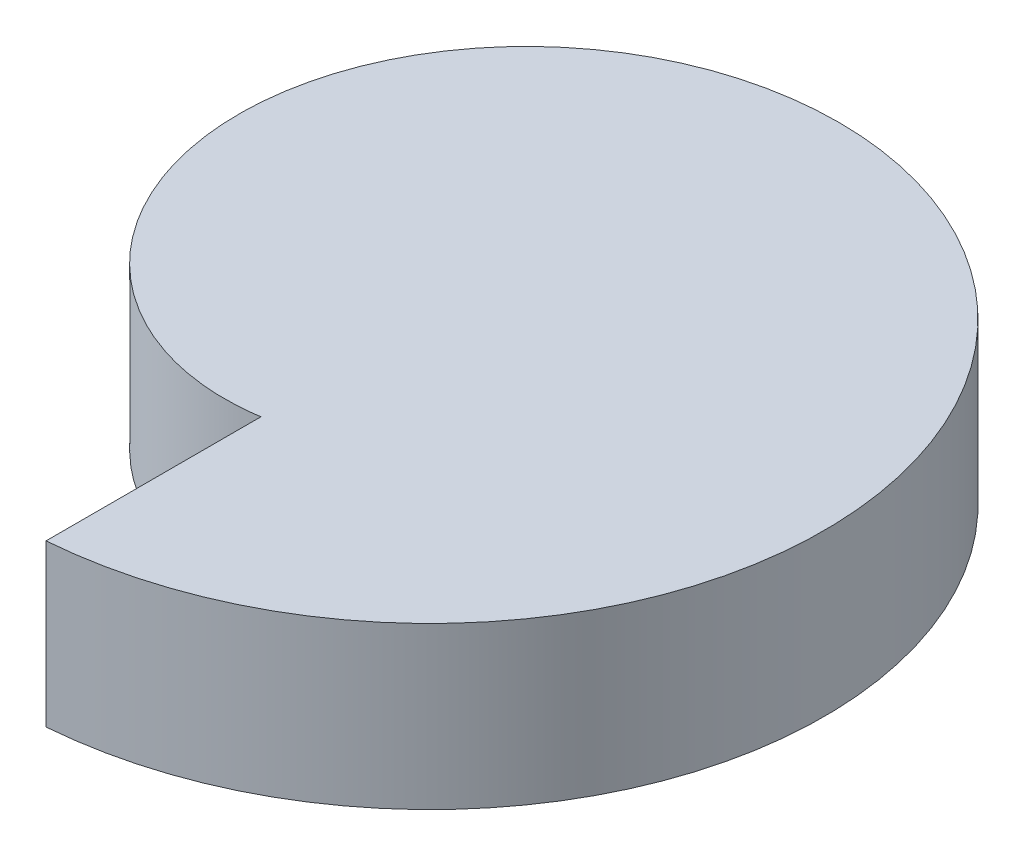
ISO-10303-21;
HEADER;
FILE_DESCRIPTION(('STEP AP214'),'2;1');
FILE_NAME('part.step','',(''),(''),'','','');
FILE_SCHEMA(('AUTOMOTIVE_DESIGN { 1 0 10303 214 1 1 1 1 }'));
ENDSEC;
DATA;
#1=APPLICATION_CONTEXT('core data for automotive mechanical design processes');
#2=APPLICATION_PROTOCOL_DEFINITION('international standard','automotive_design',2000,#1);
#3=PRODUCT_CONTEXT('',#1,'mechanical');
#4=PRODUCT('Part','Part','',(#3));
#5=PRODUCT_RELATED_PRODUCT_CATEGORY('part','',(#4));
#6=PRODUCT_DEFINITION_FORMATION('','',#4);
#7=PRODUCT_DEFINITION_CONTEXT('part definition',#1,'design');
#8=PRODUCT_DEFINITION('design','',#6,#7);
#9=PRODUCT_DEFINITION_SHAPE('','',#8);
#10=(LENGTH_UNIT() NAMED_UNIT(*) SI_UNIT(.MILLI.,.METRE.));
#11=(NAMED_UNIT(*) PLANE_ANGLE_UNIT() SI_UNIT($,.RADIAN.));
#12=(NAMED_UNIT(*) SI_UNIT($,.STERADIAN.) SOLID_ANGLE_UNIT());
#13=UNCERTAINTY_MEASURE_WITH_UNIT(LENGTH_MEASURE(1.E-05),#10,'distance_accuracy_value','');
#14=(GEOMETRIC_REPRESENTATION_CONTEXT(3) GLOBAL_UNCERTAINTY_ASSIGNED_CONTEXT((#13)) GLOBAL_UNIT_ASSIGNED_CONTEXT((#10,
#11,#12)) REPRESENTATION_CONTEXT('',''));
#15=CARTESIAN_POINT('',(0.,0.,0.));
#16=DIRECTION('',(0.,0.,1.));
#17=DIRECTION('',(1.,0.,0.));
#18=AXIS2_PLACEMENT_3D('',#15,#16,#17);
#19=CARTESIAN_POINT('',(0.,30.,80.45));
#20=CARTESIAN_POINT('',(5.2654401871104,30.,80.0333333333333));
#21=CARTESIAN_POINT('',(10.4484152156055,30.,79.0981303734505));
#22=CARTESIAN_POINT('',(20.4538917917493,30.,76.2582580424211));
#23=CARTESIAN_POINT('',(25.2761619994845,30.,74.353739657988));
#24=CARTESIAN_POINT('',(34.3841851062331,30.,69.6790794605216));
#25=CARTESIAN_POINT('',(38.6697443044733,30.,66.909129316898));
#26=CARTESIAN_POINT('',(46.5547294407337,30.,60.6383092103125));
#27=CARTESIAN_POINT('',(50.1540061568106,30.,57.1376627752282));
#28=CARTESIAN_POINT('',(56.5484071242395,30.,49.5647505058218));
#29=CARTESIAN_POINT('',(59.3434314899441,30.,45.4927301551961));
#30=CARTESIAN_POINT('',(64.0466589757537,30.,36.9538924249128));
#31=CARTESIAN_POINT('',(65.9548142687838,30.,32.4873319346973));
#32=CARTESIAN_POINT('',(68.839209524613,30.,23.3461808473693));
#33=CARTESIAN_POINT('',(69.8154542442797,30.,18.6718477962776));
#34=CARTESIAN_POINT('',(70.8291549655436,30.,9.30410438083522));
#35=CARTESIAN_POINT('',(70.8666666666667,30.,4.6109417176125));
#36=CARTESIAN_POINT('',(70.0333333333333,30.,-4.61094171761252));
#37=CARTESIAN_POINT('',(69.1625912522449,30.,-9.13943446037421));
#38=CARTESIAN_POINT('',(66.5780915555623,30.,-17.861066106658));
#39=CARTESIAN_POINT('',(64.86447861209,30.,-22.0540054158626));
#40=CARTESIAN_POINT('',(60.6907498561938,30.,-29.9526730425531));
#41=CARTESIAN_POINT('',(58.2308133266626,30.,-33.6582375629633));
#42=CARTESIAN_POINT('',(52.687232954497,30.,-40.4548315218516));
#43=CARTESIAN_POINT('',(49.6037946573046,30.,-43.5457386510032));
#44=CARTESIAN_POINT('',(42.9564830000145,30.,-49.0145390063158));
#45=CARTESIAN_POINT('',(39.3928322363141,30.,-51.3923552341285));
#46=CARTESIAN_POINT('',(31.9423856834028,30.,-55.3683429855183));
#47=CARTESIAN_POINT('',(28.0558198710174,30.,-56.9664846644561));
#48=CARTESIAN_POINT('',(20.1240242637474,30.,-59.349948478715));
#49=CARTESIAN_POINT('',(16.0790221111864,30.,-60.1352877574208));
#50=CARTESIAN_POINT('',(7.9951236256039,30.,-60.8936158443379));
#51=CARTESIAN_POINT('',(3.95644324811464,30.,-60.8666666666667));
#52=CARTESIAN_POINT('',(-3.95644324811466,30.,-60.0333333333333));
#53=CARTESIAN_POINT('',(-7.83045370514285,30.,-59.2270521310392));
#54=CARTESIAN_POINT('',(-15.2682404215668,30.,-56.8979250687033));
#55=CARTESIAN_POINT('',(-18.8318488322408,30.,-55.375217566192));
#56=CARTESIAN_POINT('',(-25.5211609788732,30.,-51.7024202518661));
#57=CARTESIAN_POINT('',(-28.6467308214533,30.,-49.5524973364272));
#58=CARTESIAN_POINT('',(-34.3549336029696,30.,-44.7361566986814));
#59=CARTESIAN_POINT('',(-36.9374711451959,30.,-42.069926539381));
#60=CARTESIAN_POINT('',(-41.4806708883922,30.,-36.3482154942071));
#61=CARTESIAN_POINT('',(-43.441278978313,30.,-33.2929343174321));
#62=CARTESIAN_POINT('',(-46.6900269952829,30.,-26.9308789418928));
#63=CARTESIAN_POINT('',(-47.9781550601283,30.,-23.6243078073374));
#64=CARTESIAN_POINT('',(-49.860687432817,30.,-16.9018676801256));
#65=CARTESIAN_POINT('',(-50.4551212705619,30.,-13.4861964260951));
#66=CARTESIAN_POINT('',(-50.9580767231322,30.,-6.68614287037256));
#67=CARTESIAN_POINT('',(-50.8666666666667,30.,-3.30194477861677));
#68=CARTESIAN_POINT('',(-50.0333333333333,30.,3.30194477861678));
#69=CARTESIAN_POINT('',(-49.2915130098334,30.,6.52147294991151));
#70=CARTESIAN_POINT('',(-47.2177585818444,30.,12.6754147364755));
#71=CARTESIAN_POINT('',(-45.885956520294,30.,15.6096922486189));
#72=CARTESIAN_POINT('',(-42.7140906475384,30.,21.0896489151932));
#73=CARTESIAN_POINT('',(-40.8741813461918,30.,23.6352240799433));
#74=CARTESIAN_POINT('',(-36.7850804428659,30.,28.2550356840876));
#75=CARTESIAN_POINT('',(-34.5360584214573,30.,30.3292036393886));
#76=CARTESIAN_POINT('',(-29.7399479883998,30.,33.9468027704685));
#77=CARTESIAN_POINT('',(-27.1930363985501,30.,35.4902027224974));
#78=CARTESIAN_POINT('',(-21.9193722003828,30.,38.0117110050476));
#79=CARTESIAN_POINT('',(-19.1927957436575,30.,38.9898254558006));
#80=CARTESIAN_POINT('',(-13.6797110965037,30.,40.3714263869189));
#81=CARTESIAN_POINT('',(-10.8933707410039,30.,40.774954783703));
#82=CARTESIAN_POINT('',(-5.37716211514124,30.,41.0225376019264));
#83=CARTESIAN_POINT('',(-2.6474463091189,30.,40.8666666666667));
#84=CARTESIAN_POINT('',(0.,30.,40.45));
#85=B_SPLINE_CURVE_WITH_KNOTS('',3,(#19,#20,#21,#22,#23,#24,#25,#26,#27,#28,#29,#30,#31,#32,#33,
#34,#35,#36,#37,#38,#39,#40,#41,#42,#43,#44,#45,#46,#47,#48,#49,#50,#51,#52,#53,#54,#55,#56,#57,
#58,#59,#60,#61,#62,#63,#64,#65,#66,#67,#68,#69,#70,#71,#72,#73,#74,#75,#76,#77,#78,#79,#80,#81,
#82,#83,#84),.UNSPECIFIED.,.F.,.F.,(4,2,2,2,2,2,2,2,2,2,2,2,2,2,2,2,2,2,2,2,2,2,2,2,2,2,2,2,2,2,
2,2,4),(0.,0.0312499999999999,0.0624999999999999,0.0937499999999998,0.125,0.15625,0.1875,
0.218749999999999,0.249999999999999,0.281249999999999,0.312499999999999,0.343749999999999,
0.374999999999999,0.406249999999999,0.437499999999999,0.468749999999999,0.499999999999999,
0.53125,0.5625,0.59375,0.625,0.65625,0.6875,0.71875,0.75,0.78125,0.8125,0.84375,0.875,0.90625,
0.9375,0.96875,1.),.UNSPECIFIED.);
#86=DIRECTION('',(0.,-1.,0.));
#87=VECTOR('',#86,1.);
#88=SURFACE_OF_LINEAR_EXTRUSION('',#85,#87);
#89=CARTESIAN_POINT('',(0.,0.,80.45));
#90=CARTESIAN_POINT('',(5.2654401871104,0.,80.0333333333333));
#91=CARTESIAN_POINT('',(10.4484152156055,0.,79.0981303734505));
#92=CARTESIAN_POINT('',(20.4538917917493,0.,76.2582580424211));
#93=CARTESIAN_POINT('',(25.2761619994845,0.,74.353739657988));
#94=CARTESIAN_POINT('',(34.3841851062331,0.,69.6790794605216));
#95=CARTESIAN_POINT('',(38.6697443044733,0.,66.909129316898));
#96=CARTESIAN_POINT('',(46.5547294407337,0.,60.6383092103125));
#97=CARTESIAN_POINT('',(50.1540061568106,0.,57.1376627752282));
#98=CARTESIAN_POINT('',(56.5484071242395,0.,49.5647505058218));
#99=CARTESIAN_POINT('',(59.3434314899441,0.,45.4927301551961));
#100=CARTESIAN_POINT('',(64.0466589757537,0.,36.9538924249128));
#101=CARTESIAN_POINT('',(65.9548142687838,0.,32.4873319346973));
#102=CARTESIAN_POINT('',(68.839209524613,0.,23.3461808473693));
#103=CARTESIAN_POINT('',(69.8154542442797,0.,18.6718477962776));
#104=CARTESIAN_POINT('',(70.8291549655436,0.,9.30410438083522));
#105=CARTESIAN_POINT('',(70.8666666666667,0.,4.6109417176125));
#106=CARTESIAN_POINT('',(70.0333333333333,0.,-4.61094171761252));
#107=CARTESIAN_POINT('',(69.1625912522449,0.,-9.13943446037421));
#108=CARTESIAN_POINT('',(66.5780915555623,0.,-17.861066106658));
#109=CARTESIAN_POINT('',(64.86447861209,0.,-22.0540054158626));
#110=CARTESIAN_POINT('',(60.6907498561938,0.,-29.9526730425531));
#111=CARTESIAN_POINT('',(58.2308133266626,0.,-33.6582375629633));
#112=CARTESIAN_POINT('',(52.687232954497,0.,-40.4548315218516));
#113=CARTESIAN_POINT('',(49.6037946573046,0.,-43.5457386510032));
#114=CARTESIAN_POINT('',(42.9564830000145,0.,-49.0145390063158));
#115=CARTESIAN_POINT('',(39.3928322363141,0.,-51.3923552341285));
#116=CARTESIAN_POINT('',(31.9423856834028,0.,-55.3683429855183));
#117=CARTESIAN_POINT('',(28.0558198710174,0.,-56.9664846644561));
#118=CARTESIAN_POINT('',(20.1240242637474,0.,-59.349948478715));
#119=CARTESIAN_POINT('',(16.0790221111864,0.,-60.1352877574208));
#120=CARTESIAN_POINT('',(7.9951236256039,0.,-60.8936158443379));
#121=CARTESIAN_POINT('',(3.95644324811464,0.,-60.8666666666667));
#122=CARTESIAN_POINT('',(-3.95644324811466,0.,-60.0333333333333));
#123=CARTESIAN_POINT('',(-7.83045370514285,0.,-59.2270521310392));
#124=CARTESIAN_POINT('',(-15.2682404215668,0.,-56.8979250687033));
#125=CARTESIAN_POINT('',(-18.8318488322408,0.,-55.375217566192));
#126=CARTESIAN_POINT('',(-25.5211609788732,0.,-51.7024202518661));
#127=CARTESIAN_POINT('',(-28.6467308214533,0.,-49.5524973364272));
#128=CARTESIAN_POINT('',(-34.3549336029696,0.,-44.7361566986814));
#129=CARTESIAN_POINT('',(-36.9374711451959,0.,-42.069926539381));
#130=CARTESIAN_POINT('',(-41.4806708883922,0.,-36.3482154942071));
#131=CARTESIAN_POINT('',(-43.441278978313,0.,-33.2929343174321));
#132=CARTESIAN_POINT('',(-46.6900269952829,0.,-26.9308789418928));
#133=CARTESIAN_POINT('',(-47.9781550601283,0.,-23.6243078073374));
#134=CARTESIAN_POINT('',(-49.860687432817,0.,-16.9018676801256));
#135=CARTESIAN_POINT('',(-50.4551212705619,0.,-13.4861964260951));
#136=CARTESIAN_POINT('',(-50.9580767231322,0.,-6.68614287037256));
#137=CARTESIAN_POINT('',(-50.8666666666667,0.,-3.30194477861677));
#138=CARTESIAN_POINT('',(-50.0333333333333,0.,3.30194477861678));
#139=CARTESIAN_POINT('',(-49.2915130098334,0.,6.52147294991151));
#140=CARTESIAN_POINT('',(-47.2177585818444,0.,12.6754147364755));
#141=CARTESIAN_POINT('',(-45.885956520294,0.,15.6096922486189));
#142=CARTESIAN_POINT('',(-42.7140906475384,0.,21.0896489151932));
#143=CARTESIAN_POINT('',(-40.8741813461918,0.,23.6352240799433));
#144=CARTESIAN_POINT('',(-36.7850804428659,0.,28.2550356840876));
#145=CARTESIAN_POINT('',(-34.5360584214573,0.,30.3292036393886));
#146=CARTESIAN_POINT('',(-29.7399479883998,0.,33.9468027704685));
#147=CARTESIAN_POINT('',(-27.1930363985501,0.,35.4902027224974));
#148=CARTESIAN_POINT('',(-21.9193722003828,0.,38.0117110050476));
#149=CARTESIAN_POINT('',(-19.1927957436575,0.,38.9898254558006));
#150=CARTESIAN_POINT('',(-13.6797110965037,0.,40.3714263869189));
#151=CARTESIAN_POINT('',(-10.8933707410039,0.,40.774954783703));
#152=CARTESIAN_POINT('',(-5.37716211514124,0.,41.0225376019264));
#153=CARTESIAN_POINT('',(-2.6474463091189,0.,40.8666666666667));
#154=CARTESIAN_POINT('',(0.,0.,40.45));
#155=B_SPLINE_CURVE_WITH_KNOTS('',3,(#89,#90,#91,#92,#93,#94,#95,#96,#97,#98,#99,#100,#101,#102,
#103,#104,#105,#106,#107,#108,#109,#110,#111,#112,#113,#114,#115,#116,#117,#118,#119,#120,#121,
#122,#123,#124,#125,#126,#127,#128,#129,#130,#131,#132,#133,#134,#135,#136,#137,#138,#139,#140,
#141,#142,#143,#144,#145,#146,#147,#148,#149,#150,#151,#152,#153,#154),.UNSPECIFIED.,.F.,.F.,(4,
2,2,2,2,2,2,2,2,2,2,2,2,2,2,2,2,2,2,2,2,2,2,2,2,2,2,2,2,2,2,2,4),(0.,0.0312499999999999,
0.0624999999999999,0.0937499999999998,0.125,0.15625,0.1875,0.218749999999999,0.249999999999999,
0.281249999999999,0.312499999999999,0.343749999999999,0.374999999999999,0.406249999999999,
0.437499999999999,0.468749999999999,0.499999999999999,0.53125,0.5625,0.59375,0.625,0.65625,
0.6875,0.71875,0.75,0.78125,0.8125,0.84375,0.875,0.90625,0.9375,0.96875,1.),.UNSPECIFIED.);
#156=CARTESIAN_POINT('',(0.,0.,80.45));
#157=VERTEX_POINT('',#156);
#158=CARTESIAN_POINT('',(0.,0.,40.45));
#159=VERTEX_POINT('',#158);
#160=EDGE_CURVE('E64',#157,#159,#155,.T.);
#161=ORIENTED_EDGE('',*,*,#160,.T.);
#162=DIRECTION('',(0.,-1.,0.));
#163=VECTOR('',#162,1.);
#164=CARTESIAN_POINT('',(0.,30.,40.45));
#165=LINE('',#164,#163);
#166=CARTESIAN_POINT('',(0.,30.,40.45));
#167=VERTEX_POINT('',#166);
#168=EDGE_CURVE('E11',#167,#159,#165,.T.);
#169=ORIENTED_EDGE('',*,*,#168,.F.);
#170=CARTESIAN_POINT('',(0.,30.,80.45));
#171=VERTEX_POINT('',#170);
#172=EDGE_CURVE('E63',#171,#167,#85,.T.);
#173=ORIENTED_EDGE('',*,*,#172,.F.);
#174=DIRECTION('',(0.,-1.,0.));
#175=VECTOR('',#174,1.);
#176=CARTESIAN_POINT('',(0.,30.,80.45));
#177=LINE('',#176,#175);
#178=EDGE_CURVE('E41',#171,#157,#177,.T.);
#179=ORIENTED_EDGE('',*,*,#178,.T.);
#180=EDGE_LOOP('',(#161,#169,#173,#179));
#181=FACE_BOUND('',#180,.T.);
#182=ADVANCED_FACE('F32',(#181),#88,.F.);
#183=CARTESIAN_POINT('',(0.,30.,40.45));
#184=DIRECTION('',(1.,0.,0.));
#185=DIRECTION('',(0.,0.,-1.));
#186=AXIS2_PLACEMENT_3D('',#183,#184,#185);
#187=PLANE('',#186);
#188=DIRECTION('',(0.,0.,1.));
#189=VECTOR('',#188,1.);
#190=CARTESIAN_POINT('',(0.,0.,40.45));
#191=LINE('',#190,#189);
#192=EDGE_CURVE('E56',#159,#157,#191,.T.);
#193=ORIENTED_EDGE('',*,*,#192,.T.);
#194=ORIENTED_EDGE('',*,*,#178,.F.);
#195=DIRECTION('',(0.,0.,1.));
#196=VECTOR('',#195,1.);
#197=CARTESIAN_POINT('',(0.,30.,40.45));
#198=LINE('',#197,#196);
#199=EDGE_CURVE('E48',#167,#171,#198,.T.);
#200=ORIENTED_EDGE('',*,*,#199,.F.);
#201=ORIENTED_EDGE('',*,*,#168,.T.);
#202=EDGE_LOOP('',(#193,#194,#200,#201));
#203=FACE_BOUND('',#202,.T.);
#204=ADVANCED_FACE('F59',(#203),#187,.F.);
#205=CARTESIAN_POINT('',(-2.19057337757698E-13,30.,-60.45));
#206=DIRECTION('',(0.,1.,0.));
#207=DIRECTION('',(0.,0.,1.));
#208=AXIS2_PLACEMENT_3D('',#205,#206,#207);
#209=PLANE('',#208);
#210=ORIENTED_EDGE('',*,*,#172,.T.);
#211=ORIENTED_EDGE('',*,*,#199,.T.);
#212=EDGE_LOOP('',(#210,#211));
#213=FACE_BOUND('',#212,.T.);
#214=ADVANCED_FACE('F81',(#213),#209,.T.);
#215=CARTESIAN_POINT('',(-2.19057337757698E-13,0.,-60.45));
#216=DIRECTION('',(0.,1.,0.));
#217=DIRECTION('',(0.,0.,1.));
#218=AXIS2_PLACEMENT_3D('',#215,#216,#217);
#219=PLANE('',#218);
#220=ORIENTED_EDGE('',*,*,#160,.F.);
#221=ORIENTED_EDGE('',*,*,#192,.F.);
#222=EDGE_LOOP('',(#220,#221));
#223=FACE_BOUND('',#222,.T.);
#224=ADVANCED_FACE('F67',(#223),#219,.F.);
#225=CLOSED_SHELL('',(#182,#204,#214,#224));
#226=MANIFOLD_SOLID_BREP('B2',#225);
#227=ADVANCED_BREP_SHAPE_REPRESENTATION('',(#18,#226),#14);
#228=SHAPE_DEFINITION_REPRESENTATION(#9,#227);
ENDSEC;
END-ISO-10303-21;
